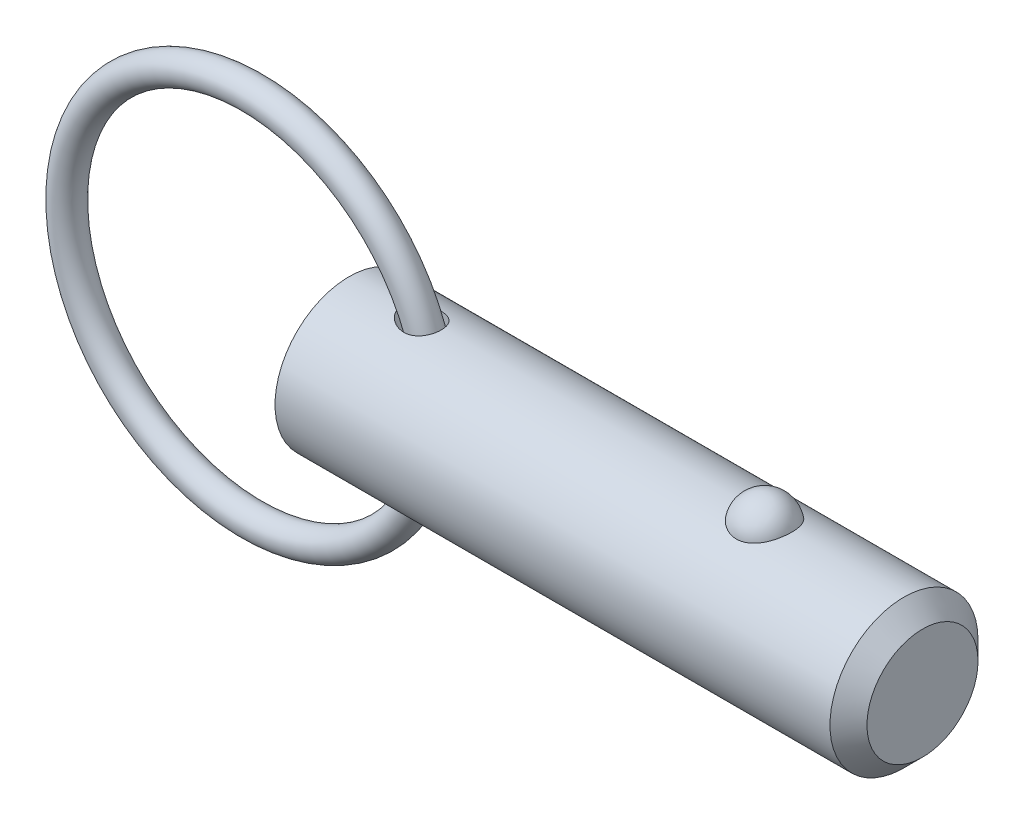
ISO-10303-21;
HEADER;
FILE_DESCRIPTION(('STEP AP214'),'2;1');
FILE_NAME('part.step','',(''),(''),'','','');
FILE_SCHEMA(('AUTOMOTIVE_DESIGN { 1 0 10303 214 1 1 1 1 }'));
ENDSEC;
DATA;
#1=APPLICATION_CONTEXT('core data for automotive mechanical design processes');
#2=APPLICATION_PROTOCOL_DEFINITION('international standard','automotive_design',2000,#1);
#3=PRODUCT_CONTEXT('',#1,'mechanical');
#4=PRODUCT('Part','Part','',(#3));
#5=PRODUCT_RELATED_PRODUCT_CATEGORY('part','',(#4));
#6=PRODUCT_DEFINITION_FORMATION('','',#4);
#7=PRODUCT_DEFINITION_CONTEXT('part definition',#1,'design');
#8=PRODUCT_DEFINITION('design','',#6,#7);
#9=PRODUCT_DEFINITION_SHAPE('','',#8);
#10=(LENGTH_UNIT() NAMED_UNIT(*) SI_UNIT(.MILLI.,.METRE.));
#11=(NAMED_UNIT(*) PLANE_ANGLE_UNIT() SI_UNIT($,.RADIAN.));
#12=(NAMED_UNIT(*) SI_UNIT($,.STERADIAN.) SOLID_ANGLE_UNIT());
#13=UNCERTAINTY_MEASURE_WITH_UNIT(LENGTH_MEASURE(1.E-05),#10,'distance_accuracy_value','');
#14=(GEOMETRIC_REPRESENTATION_CONTEXT(3) GLOBAL_UNCERTAINTY_ASSIGNED_CONTEXT((#13)) GLOBAL_UNIT_ASSIGNED_CONTEXT((#10,
#11,#12)) REPRESENTATION_CONTEXT('',''));
#15=CARTESIAN_POINT('',(0.,0.,0.));
#16=DIRECTION('',(0.,0.,1.));
#17=DIRECTION('',(1.,0.,0.));
#18=AXIS2_PLACEMENT_3D('',#15,#16,#17);
#19=CARTESIAN_POINT('',(-8.34703434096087,0.,0.));
#20=DIRECTION('',(0.,0.,1.));
#21=DIRECTION('',(1.,0.,0.));
#22=AXIS2_PLACEMENT_3D('',#19,#20,#21);
#23=TOROIDAL_SURFACE('',#22,15.875,1.27);
#24=CARTESIAN_POINT('',(8.79796565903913,0.,0.));
#25=VERTEX_POINT('',#24);
#26=VERTEX_LOOP('',#25);
#27=FACE_BOUND('',#26,.T.);
#28=ADVANCED_FACE('P0_F12',(#27),#23,.T.);
#29=CLOSED_SHELL('',(#28));
#30=MANIFOLD_SOLID_BREP('P0_B1',#29);
#31=CARTESIAN_POINT('',(0.,0.,0.));
#32=DIRECTION('',(1.,0.,0.));
#33=DIRECTION('',(0.,0.,-1.));
#34=AXIS2_PLACEMENT_3D('',#31,#32,#33);
#35=CYLINDRICAL_SURFACE('',#34,6.35);
#36=CARTESIAN_POINT('',(4.87230670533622,6.27273159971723,-0.987592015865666));
#37=CARTESIAN_POINT('',(4.94734735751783,6.26035058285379,-1.06623378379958));
#38=CARTESIAN_POINT('',(5.02968768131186,6.24755813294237,-1.13788608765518));
#39=CARTESIAN_POINT('',(5.2053426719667,6.22278258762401,-1.26640223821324));
#40=CARTESIAN_POINT('',(5.29867273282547,6.21080066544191,-1.32324497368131));
#41=CARTESIAN_POINT('',(5.49318962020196,6.18912414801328,-1.42117930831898));
#42=CARTESIAN_POINT('',(5.59435470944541,6.17942350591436,-1.46231273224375));
#43=CARTESIAN_POINT('',(5.80219659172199,6.16352555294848,-1.52793951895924));
#44=CARTESIAN_POINT('',(5.90887152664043,6.15732706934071,-1.55243845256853));
#45=CARTESIAN_POINT('',(6.12818220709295,6.14931784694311,-1.58387975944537));
#46=CARTESIAN_POINT('',(6.24090110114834,6.14763959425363,-1.59029227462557));
#47=CARTESIAN_POINT('',(6.46560233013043,6.14965588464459,-1.58248630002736));
#48=CARTESIAN_POINT('',(6.57758514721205,6.15334646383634,-1.56828303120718));
#49=CARTESIAN_POINT('',(6.78516594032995,6.1652116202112,-1.52091398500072));
#50=CARTESIAN_POINT('',(6.88126802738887,6.17288876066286,-1.48983713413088));
#51=CARTESIAN_POINT('',(7.06576629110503,6.19149190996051,-1.41052329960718));
#52=CARTESIAN_POINT('',(7.15416739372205,6.20241582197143,-1.36229738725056));
#53=CARTESIAN_POINT('',(7.31166929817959,6.2248616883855,-1.25548983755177));
#54=CARTESIAN_POINT('',(7.3818144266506,6.23621734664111,-1.19840625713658));
#55=CARTESIAN_POINT('',(7.51101296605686,6.259037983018,-1.07284763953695));
#56=CARTESIAN_POINT('',(7.57006844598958,6.2705029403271,-1.00437473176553));
#57=CARTESIAN_POINT('',(7.6737469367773,6.29184873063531,-0.860384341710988));
#58=CARTESIAN_POINT('',(7.71876694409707,6.30176816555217,-0.785157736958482));
#59=CARTESIAN_POINT('',(7.79574491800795,6.31935829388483,-0.628053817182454));
#60=CARTESIAN_POINT('',(7.82770308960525,6.32702902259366,-0.546176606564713));
#61=CARTESIAN_POINT('',(7.87788845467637,6.33930929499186,-0.377876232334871));
#62=CARTESIAN_POINT('',(7.89608106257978,6.34391112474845,-0.291442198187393));
#63=CARTESIAN_POINT('',(7.9182072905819,6.34953044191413,-0.116652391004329));
#64=CARTESIAN_POINT('',(7.92214044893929,6.35054781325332,-0.0282965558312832));
#65=CARTESIAN_POINT('',(7.91564686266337,6.34888556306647,0.148263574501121));
#66=CARTESIAN_POINT('',(7.90515337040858,6.34618875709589,0.236465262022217));
#67=CARTESIAN_POINT('',(7.8699153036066,6.33735741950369,0.409798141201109));
#68=CARTESIAN_POINT('',(7.84517062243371,6.33122286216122,0.494929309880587));
#69=CARTESIAN_POINT('',(7.7819985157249,6.31618517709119,0.659657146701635));
#70=CARTESIAN_POINT('',(7.74357645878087,6.30728313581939,0.739255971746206));
#71=CARTESIAN_POINT('',(7.65396632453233,6.28769050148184,0.890663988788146));
#72=CARTESIAN_POINT('',(7.60277911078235,6.27700002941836,0.962473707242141));
#73=CARTESIAN_POINT('',(7.48925881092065,6.2550822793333,1.09590260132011));
#74=CARTESIAN_POINT('',(7.42698604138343,6.24385813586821,1.15757361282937));
#75=CARTESIAN_POINT('',(7.29283556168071,6.2220655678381,1.26951234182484));
#76=CARTESIAN_POINT('',(7.22095880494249,6.21149707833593,1.31978118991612));
#77=CARTESIAN_POINT('',(7.06971853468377,6.19216002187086,1.40772509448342));
#78=CARTESIAN_POINT('',(6.99035873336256,6.18339056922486,1.44540635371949));
#79=CARTESIAN_POINT('',(6.82642723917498,6.16851603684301,1.50762653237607));
#80=CARTESIAN_POINT('',(6.7418548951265,6.16241129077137,1.53216380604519));
#81=CARTESIAN_POINT('',(6.56686412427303,6.15321474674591,1.56869994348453));
#82=CARTESIAN_POINT('',(6.47634467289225,6.15023369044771,1.58023897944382));
#83=CARTESIAN_POINT('',(6.29456956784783,6.14778331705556,1.58974172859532));
#84=CARTESIAN_POINT('',(6.20331368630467,6.1483151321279,1.58770106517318));
#85=CARTESIAN_POINT('',(6.01385969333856,6.15284811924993,1.5700487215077));
#86=CARTESIAN_POINT('',(5.91578322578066,6.15715979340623,1.55322212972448));
#87=CARTESIAN_POINT('',(5.72331909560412,6.16902415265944,1.5054032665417));
#88=CARTESIAN_POINT('',(5.6289344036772,6.17657939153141,1.4743998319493));
#89=CARTESIAN_POINT('',(5.4357260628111,6.19502494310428,1.39499475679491));
#90=CARTESIAN_POINT('',(5.33755891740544,6.20619097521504,1.34505268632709));
#91=CARTESIAN_POINT('',(5.15090047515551,6.23006191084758,1.22975103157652));
#92=CARTESIAN_POINT('',(5.06240741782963,6.24276653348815,1.16439425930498));
#93=CARTESIAN_POINT('',(4.91171642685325,6.26607433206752,1.03083814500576));
#94=CARTESIAN_POINT('',(4.84758224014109,6.27668356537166,0.964825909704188));
#95=CARTESIAN_POINT('',(4.73090054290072,6.29683133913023,0.823112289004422));
#96=CARTESIAN_POINT('',(4.67833688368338,6.30637136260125,0.747424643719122));
#97=CARTESIAN_POINT('',(4.59543145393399,6.32183254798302,0.601150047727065));
#98=CARTESIAN_POINT('',(4.56283099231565,6.32809321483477,0.531883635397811));
#99=CARTESIAN_POINT('',(4.50941370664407,6.33849198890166,0.388778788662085));
#100=CARTESIAN_POINT('',(4.48858876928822,6.34263155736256,0.314943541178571));
#101=CARTESIAN_POINT('',(4.46008864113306,6.3483236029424,0.164282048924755));
#102=CARTESIAN_POINT('',(4.45247558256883,6.34986385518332,0.08744340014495));
#103=CARTESIAN_POINT('',(4.45121096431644,6.35011863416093,-0.0663538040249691));
#104=CARTESIAN_POINT('',(4.45755802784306,6.34883343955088,-0.143312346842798));
#105=CARTESIAN_POINT('',(4.48267656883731,6.34380948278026,-0.288945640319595));
#106=CARTESIAN_POINT('',(4.50045680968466,6.34026665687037,-0.357802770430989));
#107=CARTESIAN_POINT('',(4.54636050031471,6.33128211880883,-0.491815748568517));
#108=CARTESIAN_POINT('',(4.57448566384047,6.32584009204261,-0.556970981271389));
#109=CARTESIAN_POINT('',(4.64209700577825,6.31308107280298,-0.687092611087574));
#110=CARTESIAN_POINT('',(4.68226903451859,6.30565525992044,-0.751689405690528));
#111=CARTESIAN_POINT('',(4.77120834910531,6.28979741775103,-0.874524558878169));
#112=CARTESIAN_POINT('',(4.81998302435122,6.28136452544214,-0.932757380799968));
#113=CARTESIAN_POINT('',(4.87230670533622,6.27273159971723,-0.987592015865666));
#114=B_SPLINE_CURVE_WITH_KNOTS('',3,(#36,#37,#38,#39,#40,#41,#42,#43,#44,#45,#46,#47,#48,#49,
#50,#51,#52,#53,#54,#55,#56,#57,#58,#59,#60,#61,#62,#63,#64,#65,#66,#67,#68,#69,#70,#71,#72,#73,
#74,#75,#76,#77,#78,#79,#80,#81,#82,#83,#84,#85,#86,#87,#88,#89,#90,#91,#92,#93,#94,#95,#96,#97,
#98,#99,#100,#101,#102,#103,#104,#105,#106,#107,#108,#109,#110,#111,#112,#113),.UNSPECIFIED.,
.T.,.F.,(4,2,2,2,2,2,2,2,2,2,2,2,2,2,2,2,2,2,2,2,2,2,2,2,2,2,2,2,2,2,2,2,2,2,2,2,2,2,4),(0.,
0.327902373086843,0.65626964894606,0.983756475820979,1.31113357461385,1.64800657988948,
1.98463099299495,2.28681225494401,2.58879878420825,2.86088594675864,3.13292229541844,
3.3963648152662,3.65980320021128,3.92390128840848,4.18800792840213,4.45334062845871,
4.7186753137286,4.98390596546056,5.24911867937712,5.51293017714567,5.7767155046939,
6.04037065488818,6.30405880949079,6.57680801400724,6.84964512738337,7.14724526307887,
7.44508014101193,7.77572668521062,8.10631295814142,8.38318772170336,8.65967357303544,
8.88915303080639,9.11847418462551,9.34887088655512,9.57924486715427,9.79193291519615,
10.0046562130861,10.2330958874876,10.4617327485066),.UNSPECIFIED.);
#115=CARTESIAN_POINT('',(4.87230670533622,6.27273159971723,-0.987592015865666));
#116=VERTEX_POINT('',#115);
#117=EDGE_CURVE('P1_E40',#116,#116,#114,.T.);
#118=ORIENTED_EDGE('',*,*,#117,.T.);
#119=EDGE_LOOP('',(#118));
#120=FACE_BOUND('',#119,.T.);
#121=CARTESIAN_POINT('',(47.6125,0.,0.));
#122=DIRECTION('',(1.,0.,0.));
#123=DIRECTION('',(0.,0.,-1.));
#124=AXIS2_PLACEMENT_3D('',#121,#122,#123);
#125=CIRCLE('',#124,6.35);
#126=CARTESIAN_POINT('',(47.6125,0.,-6.35));
#127=VERTEX_POINT('',#126);
#128=EDGE_CURVE('P1_E25',#127,#127,#125,.T.);
#129=ORIENTED_EDGE('',*,*,#128,.F.);
#130=EDGE_LOOP('',(#129));
#131=FACE_BOUND('',#130,.T.);
#132=CARTESIAN_POINT('',(0.,0.,0.));
#133=DIRECTION('',(1.,0.,0.));
#134=DIRECTION('',(0.,0.,-1.));
#135=AXIS2_PLACEMENT_3D('',#132,#133,#134);
#136=CIRCLE('',#135,6.35);
#137=CARTESIAN_POINT('',(0.,0.,-6.35));
#138=VERTEX_POINT('',#137);
#139=EDGE_CURVE('P1_E9',#138,#138,#136,.T.);
#140=ORIENTED_EDGE('',*,*,#139,.T.);
#141=EDGE_LOOP('',(#140));
#142=FACE_BOUND('',#141,.T.);
#143=CARTESIAN_POINT('',(35.6500214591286,5.87502187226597,2.40969251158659));
#144=CARTESIAN_POINT('',(35.5250305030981,5.87501645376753,2.40969773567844));
#145=CARTESIAN_POINT('',(35.4000806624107,5.87916061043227,2.39967292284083));
#146=CARTESIAN_POINT('',(35.1539091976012,5.8952311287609,2.3599173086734));
#147=CARTESIAN_POINT('',(35.0326863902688,5.90715499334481,2.33019283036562));
#148=CARTESIAN_POINT('',(34.7975170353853,5.93739567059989,2.25201402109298));
#149=CARTESIAN_POINT('',(34.6835602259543,5.95570321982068,2.20358681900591));
#150=CARTESIAN_POINT('',(34.46557352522,5.99672067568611,2.08937987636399));
#151=CARTESIAN_POINT('',(34.3615457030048,6.01943149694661,2.02359652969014));
#152=CARTESIAN_POINT('',(34.1629437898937,6.06760647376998,1.87428969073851));
#153=CARTESIAN_POINT('',(34.0687268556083,6.09313095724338,1.79031110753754));
#154=CARTESIAN_POINT('',(33.8952557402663,6.14375873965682,1.60800178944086));
#155=CARTESIAN_POINT('',(33.8160043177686,6.16886196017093,1.50966841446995));
#156=CARTESIAN_POINT('',(33.6708457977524,6.21724600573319,1.29645884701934));
#157=CARTESIAN_POINT('',(33.6056885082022,6.24039621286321,1.18104158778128));
#158=CARTESIAN_POINT('',(33.4947035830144,6.28117277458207,0.940351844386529));
#159=CARTESIAN_POINT('',(33.4488776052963,6.29879865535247,0.815078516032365));
#160=CARTESIAN_POINT('',(33.3770234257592,6.32692073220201,0.556494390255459));
#161=CARTESIAN_POINT('',(33.351249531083,6.33732517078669,0.423102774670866));
#162=CARTESIAN_POINT('',(33.3209885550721,6.34957673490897,0.15354272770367));
#163=CARTESIAN_POINT('',(33.3165009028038,6.35142408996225,0.0173743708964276));
#164=CARTESIAN_POINT('',(33.3288655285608,6.34638925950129,-0.253036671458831));
#165=CARTESIAN_POINT('',(33.3455949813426,6.33955731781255,-0.387285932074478));
#166=CARTESIAN_POINT('',(33.399843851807,6.31794129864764,-0.650851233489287));
#167=CARTESIAN_POINT('',(33.4373636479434,6.30315707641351,-0.780167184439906));
#168=CARTESIAN_POINT('',(33.532500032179,6.26711642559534,-1.03041949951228));
#169=CARTESIAN_POINT('',(33.590143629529,6.24585130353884,-1.15134433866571));
#170=CARTESIAN_POINT('',(33.7243522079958,6.19905619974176,-1.38129800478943));
#171=CARTESIAN_POINT('',(33.800918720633,6.17352587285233,-1.49032586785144));
#172=CARTESIAN_POINT('',(33.9717538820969,6.12080227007,-1.69393164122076));
#173=CARTESIAN_POINT('',(34.0661008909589,6.09360200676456,-1.78844209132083));
#174=CARTESIAN_POINT('',(34.2701196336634,6.04070434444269,-1.95970536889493));
#175=CARTESIAN_POINT('',(34.3797900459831,6.01500681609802,-2.03645972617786));
#176=CARTESIAN_POINT('',(34.6091876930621,5.96867714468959,-2.1684564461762));
#177=CARTESIAN_POINT('',(34.7286522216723,5.94794910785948,-2.2241206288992));
#178=CARTESIAN_POINT('',(34.9762188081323,5.91340580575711,-2.31440992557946));
#179=CARTESIAN_POINT('',(35.1043175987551,5.89958794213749,-2.3490429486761));
#180=CARTESIAN_POINT('',(35.358582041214,5.88111049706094,-2.39491590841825));
#181=CARTESIAN_POINT('',(35.4845207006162,5.87602512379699,-2.40724512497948));
#182=CARTESIAN_POINT('',(35.7367867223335,5.87428980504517,-2.41147867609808));
#183=CARTESIAN_POINT('',(35.863114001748,5.87763817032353,-2.40338710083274));
#184=CARTESIAN_POINT('',(36.1084170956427,5.89212921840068,-2.367627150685));
#185=CARTESIAN_POINT('',(36.2274992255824,5.90302431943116,-2.34058030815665));
#186=CARTESIAN_POINT('',(36.4592447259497,5.93113752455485,-2.26839066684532));
#187=CARTESIAN_POINT('',(36.5719075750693,5.94835614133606,-2.22324640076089));
#188=CARTESIAN_POINT('',(36.7904009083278,5.98773016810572,-2.11493806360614));
#189=CARTESIAN_POINT('',(36.896028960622,6.00998499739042,-2.05140269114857));
#190=CARTESIAN_POINT('',(37.0953006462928,6.05690144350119,-1.90842705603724));
#191=CARTESIAN_POINT('',(37.1889415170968,6.08156361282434,-1.82898313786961));
#192=CARTESIAN_POINT('',(37.3666754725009,6.13211715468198,-1.65182429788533));
#193=CARTESIAN_POINT('',(37.450055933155,6.15800825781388,-1.55339381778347));
#194=CARTESIAN_POINT('',(37.5997900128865,6.20712834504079,-1.34374214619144));
#195=CARTESIAN_POINT('',(37.6661405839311,6.23035685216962,-1.23251867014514));
#196=CARTESIAN_POINT('',(37.7823455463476,6.27251177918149,-0.996447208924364));
#197=CARTESIAN_POINT('',(37.8316072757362,6.29127762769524,-0.871278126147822));
#198=CARTESIAN_POINT('',(37.9096142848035,6.3215862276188,-0.613870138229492));
#199=CARTESIAN_POINT('',(37.9383593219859,6.33312889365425,-0.481631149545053));
#200=CARTESIAN_POINT('',(37.9747705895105,6.34782349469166,-0.213672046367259));
#201=CARTESIAN_POINT('',(37.9824134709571,6.35096613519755,-0.0779482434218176));
#202=CARTESIAN_POINT('',(37.9763951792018,6.34851322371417,0.192943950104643));
#203=CARTESIAN_POINT('',(37.9627343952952,6.3429178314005,0.328112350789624));
#204=CARTESIAN_POINT('',(37.9145036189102,6.32360512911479,0.593406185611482));
#205=CARTESIAN_POINT('',(37.8800313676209,6.30992579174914,0.723552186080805));
#206=CARTESIAN_POINT('',(37.7909539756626,6.27586325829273,0.97583417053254));
#207=CARTESIAN_POINT('',(37.7363476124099,6.25547965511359,1.09796966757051));
#208=CARTESIAN_POINT('',(37.6077587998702,6.20998183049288,1.33148921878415));
#209=CARTESIAN_POINT('',(37.5336742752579,6.18484288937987,1.44281227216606));
#210=CARTESIAN_POINT('',(37.3678204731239,6.13258735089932,1.65087683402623));
#211=CARTESIAN_POINT('',(37.2760515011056,6.10547078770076,1.74761859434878));
#212=CARTESIAN_POINT('',(37.0771839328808,6.05235879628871,1.92350926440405));
#213=CARTESIAN_POINT('',(36.970133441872,6.0263601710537,2.00271146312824));
#214=CARTESIAN_POINT('',(36.7431384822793,5.97843747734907,2.14154159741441));
#215=CARTESIAN_POINT('',(36.623191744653,5.95651412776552,2.20116608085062));
#216=CARTESIAN_POINT('',(36.3645236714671,5.91812106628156,2.30250570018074));
#217=CARTESIAN_POINT('',(36.2250698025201,5.90217533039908,2.34256795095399));
#218=CARTESIAN_POINT('',(35.9403974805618,5.88063128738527,2.39615214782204));
#219=CARTESIAN_POINT('',(35.7951817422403,5.8750281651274,2.40968644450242));
#220=CARTESIAN_POINT('',(35.6500214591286,5.87502187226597,2.40969251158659));
#221=B_SPLINE_CURVE_WITH_KNOTS('',3,(#143,#144,#145,#146,#147,#148,#149,#150,#151,#152,#153,
#154,#155,#156,#157,#158,#159,#160,#161,#162,#163,#164,#165,#166,#167,#168,#169,#170,#171,#172,
#173,#174,#175,#176,#177,#178,#179,#180,#181,#182,#183,#184,#185,#186,#187,#188,#189,#190,#191,
#192,#193,#194,#195,#196,#197,#198,#199,#200,#201,#202,#203,#204,#205,#206,#207,#208,#209,#210,
#211,#212,#213,#214,#215,#216,#217,#218,#219,#220),.UNSPECIFIED.,.T.,.F.,(4,2,2,2,2,2,2,2,2,2,2,
2,2,2,2,2,2,2,2,2,2,2,2,2,2,2,2,2,2,2,2,2,2,2,2,2,2,2,4),(0.,0.374440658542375,0.74876119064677,
1.12254078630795,1.49639810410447,1.88098871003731,2.26565013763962,2.6674110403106,
3.06920639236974,3.47601794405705,3.88281858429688,4.28727498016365,4.69173873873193,
5.09674745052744,5.50178895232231,5.90865911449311,6.31549420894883,6.71369855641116,
7.11175305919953,7.48978077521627,7.86773278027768,8.23383886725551,8.59997464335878,
8.97409044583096,9.34829231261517,9.74122667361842,10.1342313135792,10.5397522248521,
10.9452779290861,11.3512521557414,11.7572189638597,12.1612938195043,12.5653932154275,
12.9716540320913,13.3779078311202,13.7829098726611,14.1879832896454,14.6230486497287,
15.0579114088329),.UNSPECIFIED.);
#222=CARTESIAN_POINT('',(35.6500214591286,5.87502187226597,2.40969251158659));
#223=VERTEX_POINT('',#222);
#224=EDGE_CURVE('P1_E34',#223,#223,#221,.T.);
#225=ORIENTED_EDGE('',*,*,#224,.T.);
#226=EDGE_LOOP('',(#225));
#227=FACE_BOUND('',#226,.T.);
#228=CARTESIAN_POINT('',(4.87230670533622,-6.27273159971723,-0.987592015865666));
#229=CARTESIAN_POINT('',(4.81440819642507,-6.28228431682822,-0.926913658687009));
#230=CARTESIAN_POINT('',(4.76085022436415,-6.29159289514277,-0.862071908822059));
#231=CARTESIAN_POINT('',(4.66448472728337,-6.3088950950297,-0.72465504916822));
#232=CARTESIAN_POINT('',(4.62166818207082,-6.31688981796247,-0.652086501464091));
#233=CARTESIAN_POINT('',(4.54882773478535,-6.33076917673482,-0.49974775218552));
#234=CARTESIAN_POINT('',(4.51891553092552,-6.33663532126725,-0.419921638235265));
#235=CARTESIAN_POINT('',(4.47476924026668,-6.3453711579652,-0.255882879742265));
#236=CARTESIAN_POINT('',(4.46051880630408,-6.34824397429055,-0.171674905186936));
#237=CARTESIAN_POINT('',(4.44966179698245,-6.35043041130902,-0.0120763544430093));
#238=CARTESIAN_POINT('',(4.45117530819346,-6.35012328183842,0.0631849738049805));
#239=CARTESIAN_POINT('',(4.46726452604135,-6.34689000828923,0.212230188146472));
#240=CARTESIAN_POINT('',(4.48184026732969,-6.3439638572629,0.286014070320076));
#241=CARTESIAN_POINT('',(4.52202068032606,-6.33603071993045,0.426550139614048));
#242=CARTESIAN_POINT('',(4.54707079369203,-6.33112875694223,0.493469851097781));
#243=CARTESIAN_POINT('',(4.6066985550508,-6.31972370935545,0.622743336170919));
#244=CARTESIAN_POINT('',(4.64127887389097,-6.31322017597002,0.685095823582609));
#245=CARTESIAN_POINT('',(4.72328142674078,-6.29826068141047,0.811769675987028));
#246=CARTESIAN_POINT('',(4.77176118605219,-6.28966287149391,0.875386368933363));
#247=CARTESIAN_POINT('',(4.87703902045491,-6.27182325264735,0.99519278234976));
#248=CARTESIAN_POINT('',(4.93384225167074,-6.26258104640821,1.05137785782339));
#249=CARTESIAN_POINT('',(5.0661743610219,-6.24228878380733,1.16635591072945));
#250=CARTESIAN_POINT('',(5.1431816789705,-6.23124423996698,1.22345054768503));
#251=CARTESIAN_POINT('',(5.30475767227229,-6.21023402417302,1.32598441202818));
#252=CARTESIAN_POINT('',(5.3893323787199,-6.20026922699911,1.37141422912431));
#253=CARTESIAN_POINT('',(5.5776013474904,-6.18099350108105,1.45601817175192));
#254=CARTESIAN_POINT('',(5.68224348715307,-6.17201456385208,1.4931788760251));
#255=CARTESIAN_POINT('',(5.89649087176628,-6.15800474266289,1.5499484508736));
#256=CARTESIAN_POINT('',(6.00609708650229,-6.15297463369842,1.56955387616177));
#257=CARTESIAN_POINT('',(6.22752772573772,-6.14779725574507,1.58971993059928));
#258=CARTESIAN_POINT('',(6.33935715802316,-6.14766266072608,1.59023112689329));
#259=CARTESIAN_POINT('',(6.56108231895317,-6.15269227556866,1.57066564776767));
#260=CARTESIAN_POINT('',(6.67097982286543,-6.15785133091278,1.55060899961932));
#261=CARTESIAN_POINT('',(6.87257705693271,-6.17211580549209,1.4927326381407));
#262=CARTESIAN_POINT('',(6.96494608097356,-6.18072242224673,1.45711948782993));
#263=CARTESIAN_POINT('',(7.14129343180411,-6.20069920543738,1.36960980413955));
#264=CARTESIAN_POINT('',(7.22527609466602,-6.21206793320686,1.31772174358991));
#265=CARTESIAN_POINT('',(7.37471505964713,-6.23497047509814,1.20443359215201));
#266=CARTESIAN_POINT('',(7.44115811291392,-6.24639757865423,1.14430788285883));
#267=CARTESIAN_POINT('',(7.5626186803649,-6.26896339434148,1.0134084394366));
#268=CARTESIAN_POINT('',(7.61763801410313,-6.28010215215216,0.942636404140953));
#269=CARTESIAN_POINT('',(7.71360563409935,-6.30055923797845,0.794304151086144));
#270=CARTESIAN_POINT('',(7.75485562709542,-6.3099143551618,0.716943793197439));
#271=CARTESIAN_POINT('',(7.82406051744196,-6.32610528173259,0.556244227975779));
#272=CARTESIAN_POINT('',(7.8520154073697,-6.33294108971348,0.472905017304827));
#273=CARTESIAN_POINT('',(7.89408663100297,-6.34338077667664,0.302249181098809));
#274=CARTESIAN_POINT('',(7.90814615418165,-6.34697138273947,0.214917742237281));
#275=CARTESIAN_POINT('',(7.92192329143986,-6.35048887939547,0.0390564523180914));
#276=CARTESIAN_POINT('',(7.92164046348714,-6.3504156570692,-0.0494734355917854));
#277=CARTESIAN_POINT('',(7.90670754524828,-6.34660520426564,-0.225592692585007));
#278=CARTESIAN_POINT('',(7.89199989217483,-6.34285329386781,-0.31317687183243));
#279=CARTESIAN_POINT('',(7.8484534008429,-6.33206809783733,-0.484549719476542));
#280=CARTESIAN_POINT('',(7.81961455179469,-6.32503480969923,-0.568338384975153));
#281=CARTESIAN_POINT('',(7.74850591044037,-6.30846389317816,-0.729625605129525));
#282=CARTESIAN_POINT('',(7.70625193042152,-6.29892921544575,-0.807131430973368));
#283=CARTESIAN_POINT('',(7.60933437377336,-6.27840608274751,-0.953731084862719));
#284=CARTESIAN_POINT('',(7.55467181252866,-6.2674177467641,-1.02282560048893));
#285=CARTESIAN_POINT('',(7.43471786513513,-6.24527869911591,-1.15028913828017));
#286=CARTESIAN_POINT('',(7.36948829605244,-6.23412925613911,-1.20871657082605));
#287=CARTESIAN_POINT('',(7.23001723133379,-6.21283678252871,-1.3137894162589));
#288=CARTESIAN_POINT('',(7.15577649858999,-6.20269366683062,-1.36043582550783));
#289=CARTESIAN_POINT('',(7.00025986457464,-6.18446636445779,-1.4410399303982));
#290=CARTESIAN_POINT('',(6.91896776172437,-6.17638709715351,-1.47496739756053));
#291=CARTESIAN_POINT('',(6.75184232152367,-6.16309237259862,-1.52957024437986));
#292=CARTESIAN_POINT('',(6.66600814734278,-6.15787744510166,-1.55024317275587));
#293=CARTESIAN_POINT('',(6.48842585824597,-6.15055064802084,-1.57906962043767));
#294=CARTESIAN_POINT('',(6.39658108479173,-6.14857915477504,-1.58665744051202));
#295=CARTESIAN_POINT('',(6.2127983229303,-6.14817707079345,-1.58821048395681));
#296=CARTESIAN_POINT('',(6.12086031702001,-6.14974736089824,-1.58217231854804));
#297=CARTESIAN_POINT('',(5.92996902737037,-6.15640095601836,-1.55609403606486));
#298=CARTESIAN_POINT('',(5.83120653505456,-6.16181208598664,-1.53474519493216));
#299=CARTESIAN_POINT('',(5.63804881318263,-6.17573474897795,-1.47771859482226));
#300=CARTESIAN_POINT('',(5.54365953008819,-6.18425037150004,-1.44202192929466));
#301=CARTESIAN_POINT('',(5.34413923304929,-6.20522938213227,-1.34918979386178));
#302=CARTESIAN_POINT('',(5.24033140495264,-6.21813417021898,-1.28928337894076));
#303=CARTESIAN_POINT('',(5.04554233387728,-6.24510162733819,-1.15156760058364));
#304=CARTESIAN_POINT('',(4.9545459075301,-6.25916289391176,-1.07377972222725));
#305=CARTESIAN_POINT('',(4.87230670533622,-6.27273159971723,-0.987592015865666));
#306=B_SPLINE_CURVE_WITH_KNOTS('',3,(#228,#229,#230,#231,#232,#233,#234,#235,#236,#237,#238,
#239,#240,#241,#242,#243,#244,#245,#246,#247,#248,#249,#250,#251,#252,#253,#254,#255,#256,#257,
#258,#259,#260,#261,#262,#263,#264,#265,#266,#267,#268,#269,#270,#271,#272,#273,#274,#275,#276,
#277,#278,#279,#280,#281,#282,#283,#284,#285,#286,#287,#288,#289,#290,#291,#292,#293,#294,#295,
#296,#297,#298,#299,#300,#301,#302,#303,#304,#305),.UNSPECIFIED.,.T.,.F.,(4,2,2,2,2,2,2,2,2,2,2,
2,2,2,2,2,2,2,2,2,2,2,2,2,2,2,2,2,2,2,2,2,2,2,2,2,2,2,4),(0.,0.252951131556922,
0.505689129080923,0.760572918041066,1.01519041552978,1.23982791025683,1.46446600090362,
1.67847364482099,1.89254132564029,2.13299551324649,2.37359928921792,2.6619896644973,
2.95061196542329,3.28329078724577,3.61603488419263,3.9496403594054,4.28292130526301,
4.57939201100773,4.87570862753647,5.14538810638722,5.41502459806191,5.67829123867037,
5.94155802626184,6.20589676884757,6.47024365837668,6.73564974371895,7.00105603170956,
7.26615064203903,7.53122356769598,7.79479837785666,8.05835088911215,8.32252586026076,
8.58674967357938,8.86213419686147,9.137587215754,9.43991696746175,9.74264642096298,
10.1023688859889,10.461661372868),.UNSPECIFIED.);
#307=CARTESIAN_POINT('',(4.87230670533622,-6.27273159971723,-0.987592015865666));
#308=VERTEX_POINT('',#307);
#309=EDGE_CURVE('P1_E17',#308,#308,#306,.T.);
#310=ORIENTED_EDGE('',*,*,#309,.T.);
#311=EDGE_LOOP('',(#310));
#312=FACE_BOUND('',#311,.T.);
#313=ADVANCED_FACE('P1_F13',(#120,#131,#142,#227,#312),#35,.T.);
#314=CARTESIAN_POINT('',(0.,0.,0.));
#315=DIRECTION('',(-1.,0.,0.));
#316=DIRECTION('',(0.,0.,1.));
#317=AXIS2_PLACEMENT_3D('',#314,#315,#316);
#318=PLANE('',#317);
#319=ORIENTED_EDGE('',*,*,#139,.F.);
#320=EDGE_LOOP('',(#319));
#321=FACE_BOUND('',#320,.T.);
#322=ADVANCED_FACE('P1_F15',(#321),#318,.T.);
#323=CARTESIAN_POINT('',(49.2,0.,0.));
#324=DIRECTION('',(-1.,0.,0.));
#325=DIRECTION('',(0.,0.,1.));
#326=AXIS2_PLACEMENT_3D('',#323,#324,#325);
#327=CONICAL_SURFACE('',#326,4.76250000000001,0.785398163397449);
#328=ORIENTED_EDGE('',*,*,#128,.T.);
#329=EDGE_LOOP('',(#328));
#330=FACE_BOUND('',#329,.T.);
#331=CARTESIAN_POINT('',(49.2,0.,0.));
#332=DIRECTION('',(1.,0.,0.));
#333=DIRECTION('',(0.,0.,-1.));
#334=AXIS2_PLACEMENT_3D('',#331,#332,#333);
#335=CIRCLE('',#334,4.76250000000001);
#336=CARTESIAN_POINT('',(49.2,0.,-4.76250000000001));
#337=VERTEX_POINT('',#336);
#338=EDGE_CURVE('P1_E30',#337,#337,#335,.T.);
#339=ORIENTED_EDGE('',*,*,#338,.F.);
#340=EDGE_LOOP('',(#339));
#341=FACE_BOUND('',#340,.T.);
#342=ADVANCED_FACE('P1_F55',(#330,#341),#327,.T.);
#343=CARTESIAN_POINT('',(49.2,4.76250000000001,0.));
#344=DIRECTION('',(1.,0.,0.));
#345=DIRECTION('',(0.,0.,-1.));
#346=AXIS2_PLACEMENT_3D('',#343,#344,#345);
#347=PLANE('',#346);
#348=ORIENTED_EDGE('',*,*,#338,.T.);
#349=EDGE_LOOP('',(#348));
#350=FACE_BOUND('',#349,.T.);
#351=ADVANCED_FACE('P1_F51',(#350),#347,.T.);
#352=CARTESIAN_POINT('',(35.6500214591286,5.715,0.));
#353=DIRECTION('',(-1.,0.,0.));
#354=DIRECTION('',(0.,1.,0.));
#355=AXIS2_PLACEMENT_3D('',#352,#353,#354);
#356=SPHERICAL_SURFACE('',#355,2.415);
#357=ORIENTED_EDGE('',*,*,#224,.F.);
#358=EDGE_LOOP('',(#357));
#359=FACE_BOUND('',#358,.T.);
#360=ADVANCED_FACE('P1_F46',(#359),#356,.T.);
#361=CARTESIAN_POINT('',(-8.34703434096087,0.,0.));
#362=DIRECTION('',(0.,0.,1.));
#363=DIRECTION('',(1.,0.,0.));
#364=AXIS2_PLACEMENT_3D('',#361,#362,#363);
#365=TOROIDAL_SURFACE('',#364,15.875,1.5875);
#366=ORIENTED_EDGE('',*,*,#309,.F.);
#367=EDGE_LOOP('',(#366));
#368=FACE_BOUND('',#367,.T.);
#369=ORIENTED_EDGE('',*,*,#117,.F.);
#370=EDGE_LOOP('',(#369));
#371=FACE_BOUND('',#370,.T.);
#372=ADVANCED_FACE('P1_F50',(#368,#371),#365,.F.);
#373=CLOSED_SHELL('',(#313,#322,#342,#351,#360,#372));
#374=MANIFOLD_SOLID_BREP('P1_B1',#373);
#375=ADVANCED_BREP_SHAPE_REPRESENTATION('',(#18,#30,#374),#14);
#376=SHAPE_DEFINITION_REPRESENTATION(#9,#375);
ENDSEC;
END-ISO-10303-21;
